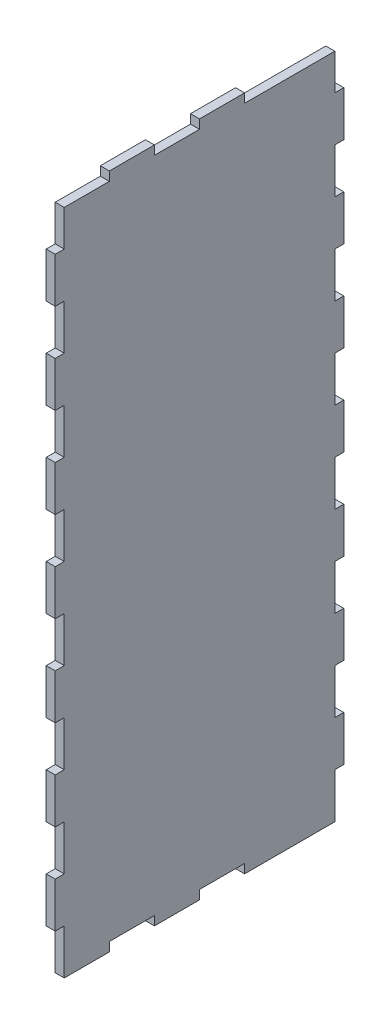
from build123d import *

# Parameters (mm, degrees)
SKETCH1_W           = 2
SKETCH1_H           = 148
BOSS_EXTRUDE1_DEPTH = 60
SKETCH2_W           = 2
SKETCH2_H           = 10
CUT_EXTRUDE1_DEPTH  = 2
LPATTERN1_COUNT     = 2
LPATTERN1_PITCH     = 20
SKETCH3_W           = 2
SKETCH3_H           = 10
BOSS_EXTRUDE2_DEPTH = 2
SKETCH4_W           = 2
SKETCH4_H           = 10
BOSS_EXTRUDE3_DEPTH = 2
LPATTERN2_COUNT     = 7
LPATTERN2_PITCH     = 20
SKETCH6_W           = 2
SKETCH6_H           = 10
BOSS_EXTRUDE4_DEPTH = 2


with BuildPart() as part:
    # Sketch1 → Boss-Extrude1 (new body)
    with BuildSketch(Plane.XY):
        with Locations((74, -1)):
            Rectangle(SKETCH1_W, SKETCH1_H)
    extrude(amount=BOSS_EXTRUDE1_DEPTH)

    # Sketch2 → Cut-Extrude1 (cut)
    with BuildSketch(Plane.XZ.offset(75)):
        with Locations((74, 45)):
            Rectangle(SKETCH2_W, SKETCH2_H)
    cut_extrude1 = extrude(amount=-CUT_EXTRUDE1_DEPTH, mode=Mode.SUBTRACT)

    # LPattern1: Cut-Extrude1 ×2
    with Locations(*[(0, 0, -i * LPATTERN1_PITCH) for i in range(1, LPATTERN1_COUNT)]):
        add(cut_extrude1, mode=Mode.SUBTRACT)

    # Sketch3 → Boss-Extrude2 (add)
    with BuildSketch(Plane(origin=(0, 73, 0), x_dir=(1, 0, 0), z_dir=(0, 1, 0))):
        with Locations((74, -25)):
            Rectangle(SKETCH3_W, SKETCH3_H)
        with Locations((74, -45)):
            Rectangle(SKETCH3_W, SKETCH3_H)
    extrude(amount=BOSS_EXTRUDE2_DEPTH)

    # Sketch4 → Boss-Extrude3 (add)
    with BuildSketch(Plane.XY.offset(60)):
        with Locations((74, -60)):
            Rectangle(SKETCH4_W, SKETCH4_H)
    boss_extrude3 = extrude(amount=BOSS_EXTRUDE3_DEPTH)

    # LPattern2: Boss-Extrude3 ×7
    with Locations(*[(0, i * LPATTERN2_PITCH, 0) for i in range(1, LPATTERN2_COUNT)]):
        add(boss_extrude3)

    # Sketch6 → Boss-Extrude4 (add)
    with BuildSketch(Plane(origin=(0, 0, 0), x_dir=(-1, 0, 0), z_dir=(0, 0, -1))):
        with Locations((-74, -60)):
            Rectangle(SKETCH6_W, SKETCH6_H)
        with Locations((-74, -40)):
            Rectangle(SKETCH6_W, SKETCH6_H)
        with Locations((-74, -20)):
            Rectangle(SKETCH6_W, SKETCH6_H)
        with Locations((-74, 0)):
            Rectangle(SKETCH6_W, SKETCH6_H)
        with Locations((-74, 20)):
            Rectangle(SKETCH6_W, SKETCH6_H)
        with Locations((-74, 40)):
            Rectangle(SKETCH6_W, SKETCH6_H)
        with Locations((-74, 60)):
            Rectangle(SKETCH6_W, SKETCH6_H)
    extrude(amount=BOSS_EXTRUDE4_DEPTH)


solid = part.part
